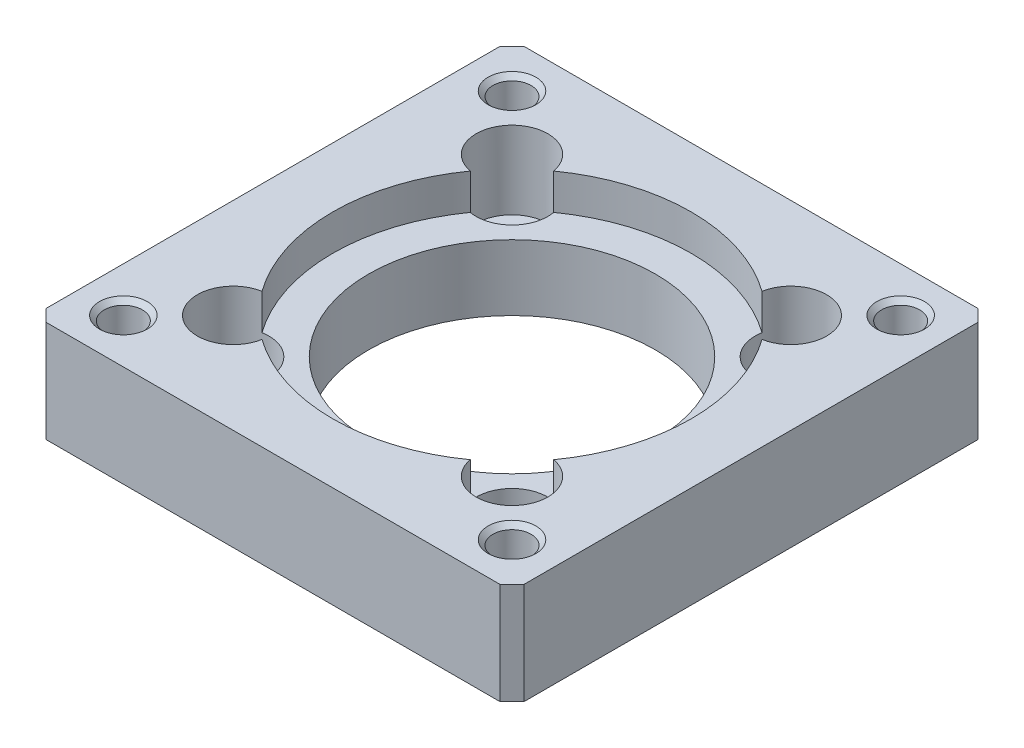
ISO-10303-21;
HEADER;
FILE_DESCRIPTION(('STEP AP214'),'2;1');
FILE_NAME('part.step','',(''),(''),'','','');
FILE_SCHEMA(('AUTOMOTIVE_DESIGN { 1 0 10303 214 1 1 1 1 }'));
ENDSEC;
DATA;
#1=APPLICATION_CONTEXT('core data for automotive mechanical design processes');
#2=APPLICATION_PROTOCOL_DEFINITION('international standard','automotive_design',2000,#1);
#3=PRODUCT_CONTEXT('',#1,'mechanical');
#4=PRODUCT('Part','Part','',(#3));
#5=PRODUCT_RELATED_PRODUCT_CATEGORY('part','',(#4));
#6=PRODUCT_DEFINITION_FORMATION('','',#4);
#7=PRODUCT_DEFINITION_CONTEXT('part definition',#1,'design');
#8=PRODUCT_DEFINITION('design','',#6,#7);
#9=PRODUCT_DEFINITION_SHAPE('','',#8);
#10=(LENGTH_UNIT() NAMED_UNIT(*) SI_UNIT(.MILLI.,.METRE.));
#11=(NAMED_UNIT(*) PLANE_ANGLE_UNIT() SI_UNIT($,.RADIAN.));
#12=(NAMED_UNIT(*) SI_UNIT($,.STERADIAN.) SOLID_ANGLE_UNIT());
#13=UNCERTAINTY_MEASURE_WITH_UNIT(LENGTH_MEASURE(1.E-05),#10,'distance_accuracy_value','');
#14=(GEOMETRIC_REPRESENTATION_CONTEXT(3) GLOBAL_UNCERTAINTY_ASSIGNED_CONTEXT((#13)) GLOBAL_UNIT_ASSIGNED_CONTEXT((#10,
#11,#12)) REPRESENTATION_CONTEXT('',''));
#15=CARTESIAN_POINT('',(0.,0.,0.));
#16=DIRECTION('',(0.,0.,1.));
#17=DIRECTION('',(1.,0.,0.));
#18=AXIS2_PLACEMENT_3D('',#15,#16,#17);
#19=CARTESIAN_POINT('',(-16.26345596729,8.10000000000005,16.26345596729));
#20=DIRECTION('',(0.,1.,0.));
#21=DIRECTION('',(0.,0.,1.));
#22=AXIS2_PLACEMENT_3D('',#19,#20,#21);
#23=CONICAL_SURFACE('',#22,1.59999999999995,0.785398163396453);
#24=CARTESIAN_POINT('',(-16.26345596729,8.1,16.26345596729));
#25=DIRECTION('',(0.,1.,0.));
#26=DIRECTION('',(1.,0.,0.));
#27=AXIS2_PLACEMENT_3D('',#24,#25,#26);
#28=CIRCLE('',#27,1.6);
#29=CARTESIAN_POINT('',(-14.66345596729,8.1,16.26345596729));
#30=VERTEX_POINT('',#29);
#31=EDGE_CURVE('E180',#30,#30,#28,.F.);
#32=ORIENTED_EDGE('',*,*,#31,.T.);
#33=EDGE_LOOP('',(#32));
#34=FACE_BOUND('',#33,.T.);
#35=CARTESIAN_POINT('',(-16.26345596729,8.50000000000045,16.26345596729));
#36=DIRECTION('',(0.,1.,0.));
#37=DIRECTION('',(0.,0.,1.));
#38=AXIS2_PLACEMENT_3D('',#35,#36,#37);
#39=CIRCLE('',#38,1.99999999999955);
#40=CARTESIAN_POINT('',(-16.26345596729,8.50000000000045,18.2634559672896));
#41=VERTEX_POINT('',#40);
#42=EDGE_CURVE('E206',#41,#41,#39,.T.);
#43=ORIENTED_EDGE('',*,*,#42,.T.);
#44=EDGE_LOOP('',(#43));
#45=FACE_BOUND('',#44,.T.);
#46=ADVANCED_FACE('F16',(#34,#45),#23,.F.);
#47=CARTESIAN_POINT('',(16.26345596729,8.10000000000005,16.26345596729));
#48=DIRECTION('',(0.,1.,0.));
#49=DIRECTION('',(0.,0.,1.));
#50=AXIS2_PLACEMENT_3D('',#47,#48,#49);
#51=CONICAL_SURFACE('',#50,1.59999999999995,0.785398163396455);
#52=CARTESIAN_POINT('',(16.26345596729,8.1,16.26345596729));
#53=DIRECTION('',(0.,1.,0.));
#54=DIRECTION('',(1.,0.,0.));
#55=AXIS2_PLACEMENT_3D('',#52,#53,#54);
#56=CIRCLE('',#55,1.6);
#57=CARTESIAN_POINT('',(17.86345596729,8.1,16.26345596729));
#58=VERTEX_POINT('',#57);
#59=EDGE_CURVE('E256',#58,#58,#56,.F.);
#60=ORIENTED_EDGE('',*,*,#59,.T.);
#61=EDGE_LOOP('',(#60));
#62=FACE_BOUND('',#61,.T.);
#63=CARTESIAN_POINT('',(16.26345596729,8.50000000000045,16.26345596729));
#64=DIRECTION('',(0.,1.,0.));
#65=DIRECTION('',(0.,0.,1.));
#66=AXIS2_PLACEMENT_3D('',#63,#64,#65);
#67=CIRCLE('',#66,1.99999999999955);
#68=CARTESIAN_POINT('',(16.26345596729,8.50000000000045,18.2634559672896));
#69=VERTEX_POINT('',#68);
#70=EDGE_CURVE('E203',#69,#69,#67,.T.);
#71=ORIENTED_EDGE('',*,*,#70,.T.);
#72=EDGE_LOOP('',(#71));
#73=FACE_BOUND('',#72,.T.);
#74=ADVANCED_FACE('F441',(#62,#73),#51,.F.);
#75=CARTESIAN_POINT('',(16.26345596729,8.10000000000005,-16.26345596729));
#76=DIRECTION('',(0.,1.,0.));
#77=DIRECTION('',(0.,0.,1.));
#78=AXIS2_PLACEMENT_3D('',#75,#76,#77);
#79=CONICAL_SURFACE('',#78,1.59999999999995,0.785398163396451);
#80=CARTESIAN_POINT('',(16.26345596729,8.1,-16.26345596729));
#81=DIRECTION('',(0.,1.,0.));
#82=DIRECTION('',(1.,0.,0.));
#83=AXIS2_PLACEMENT_3D('',#80,#81,#82);
#84=CIRCLE('',#83,1.6);
#85=CARTESIAN_POINT('',(17.86345596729,8.1,-16.26345596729));
#86=VERTEX_POINT('',#85);
#87=EDGE_CURVE('E253',#86,#86,#84,.F.);
#88=ORIENTED_EDGE('',*,*,#87,.T.);
#89=EDGE_LOOP('',(#88));
#90=FACE_BOUND('',#89,.T.);
#91=CARTESIAN_POINT('',(16.26345596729,8.50000000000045,-16.26345596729));
#92=DIRECTION('',(0.,1.,0.));
#93=DIRECTION('',(0.,0.,1.));
#94=AXIS2_PLACEMENT_3D('',#91,#92,#93);
#95=CIRCLE('',#94,1.99999999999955);
#96=CARTESIAN_POINT('',(16.26345596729,8.50000000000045,-14.2634559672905));
#97=VERTEX_POINT('',#96);
#98=EDGE_CURVE('E209',#97,#97,#95,.T.);
#99=ORIENTED_EDGE('',*,*,#98,.T.);
#100=EDGE_LOOP('',(#99));
#101=FACE_BOUND('',#100,.T.);
#102=ADVANCED_FACE('F481',(#90,#101),#79,.F.);
#103=CARTESIAN_POINT('',(-16.26345596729,8.10000000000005,-16.26345596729));
#104=DIRECTION('',(0.,1.,0.));
#105=DIRECTION('',(0.,0.,1.));
#106=AXIS2_PLACEMENT_3D('',#103,#104,#105);
#107=CONICAL_SURFACE('',#106,1.59999999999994,0.785398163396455);
#108=CARTESIAN_POINT('',(-16.26345596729,8.1,-16.26345596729));
#109=DIRECTION('',(0.,1.,0.));
#110=DIRECTION('',(1.,0.,0.));
#111=AXIS2_PLACEMENT_3D('',#108,#109,#110);
#112=CIRCLE('',#111,1.6);
#113=CARTESIAN_POINT('',(-14.66345596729,8.1,-16.26345596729));
#114=VERTEX_POINT('',#113);
#115=EDGE_CURVE('E177',#114,#114,#112,.F.);
#116=ORIENTED_EDGE('',*,*,#115,.T.);
#117=EDGE_LOOP('',(#116));
#118=FACE_BOUND('',#117,.T.);
#119=CARTESIAN_POINT('',(-16.26345596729,8.50000000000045,-16.26345596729));
#120=DIRECTION('',(0.,1.,0.));
#121=DIRECTION('',(0.,0.,1.));
#122=AXIS2_PLACEMENT_3D('',#119,#120,#121);
#123=CIRCLE('',#122,1.99999999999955);
#124=CARTESIAN_POINT('',(-16.26345596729,8.50000000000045,-14.2634559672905));
#125=VERTEX_POINT('',#124);
#126=EDGE_CURVE('E200',#125,#125,#123,.T.);
#127=ORIENTED_EDGE('',*,*,#126,.T.);
#128=EDGE_LOOP('',(#127));
#129=FACE_BOUND('',#128,.T.);
#130=ADVANCED_FACE('F488',(#118,#129),#107,.F.);
#131=CARTESIAN_POINT('',(11.66726188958,2.,-11.66726188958));
#132=DIRECTION('',(0.,1.,0.));
#133=DIRECTION('',(0.,0.,1.));
#134=AXIS2_PLACEMENT_3D('',#131,#132,#133);
#135=CYLINDRICAL_SURFACE('',#134,3.);
#136=CARTESIAN_POINT('',(11.66726188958,2.,-11.66726188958));
#137=DIRECTION('',(0.,1.,0.));
#138=DIRECTION('',(0.,0.,1.));
#139=AXIS2_PLACEMENT_3D('',#136,#137,#138);
#140=CIRCLE('',#139,3.);
#141=CARTESIAN_POINT('',(11.66726188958,2.,-8.66726188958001));
#142=VERTEX_POINT('',#141);
#143=EDGE_CURVE('E174',#142,#142,#140,.F.);
#144=ORIENTED_EDGE('',*,*,#143,.T.);
#145=EDGE_LOOP('',(#144));
#146=FACE_BOUND('',#145,.T.);
#147=DIRECTION('',(0.,-1.,0.));
#148=VECTOR('',#147,1.);
#149=CARTESIAN_POINT('',(12.2076072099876,7.,-8.7163252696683));
#150=LINE('',#149,#148);
#151=CARTESIAN_POINT('',(12.2076072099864,5.5,-8.71632526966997));
#152=VERTEX_POINT('',#151);
#153=CARTESIAN_POINT('',(12.2076072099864,8.5,-8.71632526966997));
#154=VERTEX_POINT('',#153);
#155=EDGE_CURVE('E248',#152,#154,#150,.F.);
#156=ORIENTED_EDGE('',*,*,#155,.T.);
#157=CARTESIAN_POINT('',(11.66726188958,8.5,-11.66726188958));
#158=DIRECTION('',(0.,1.,0.));
#159=DIRECTION('',(0.,0.,1.));
#160=AXIS2_PLACEMENT_3D('',#157,#158,#159);
#161=CIRCLE('',#160,3.);
#162=CARTESIAN_POINT('',(8.71632526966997,8.5,-12.2076072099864));
#163=VERTEX_POINT('',#162);
#164=EDGE_CURVE('E194',#154,#163,#161,.T.);
#165=ORIENTED_EDGE('',*,*,#164,.T.);
#166=DIRECTION('',(0.,1.,0.));
#167=VECTOR('',#166,1.);
#168=CARTESIAN_POINT('',(8.7163252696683,7.,-12.2076072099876));
#169=LINE('',#168,#167);
#170=CARTESIAN_POINT('',(8.71632526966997,5.5,-12.2076072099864));
#171=VERTEX_POINT('',#170);
#172=EDGE_CURVE('E237',#163,#171,#169,.F.);
#173=ORIENTED_EDGE('',*,*,#172,.T.);
#174=CARTESIAN_POINT('',(11.66726188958,5.5,-11.66726188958));
#175=DIRECTION('',(0.,1.,0.));
#176=DIRECTION('',(0.,0.,1.));
#177=AXIS2_PLACEMENT_3D('',#174,#175,#176);
#178=CIRCLE('',#177,3.);
#179=EDGE_CURVE('E162',#171,#152,#178,.T.);
#180=ORIENTED_EDGE('',*,*,#179,.T.);
#181=EDGE_LOOP('',(#156,#165,#173,#180));
#182=FACE_BOUND('',#181,.T.);
#183=ADVANCED_FACE('F352',(#146,#182),#135,.F.);
#184=CARTESIAN_POINT('',(0.,5.5,0.));
#185=DIRECTION('',(0.,1.,0.));
#186=DIRECTION('',(0.,0.,1.));
#187=AXIS2_PLACEMENT_3D('',#184,#185,#186);
#188=CYLINDRICAL_SURFACE('',#187,15.);
#189=CARTESIAN_POINT('',(0.,5.5,0.));
#190=DIRECTION('',(0.,1.,0.));
#191=DIRECTION('',(0.,0.,1.));
#192=AXIS2_PLACEMENT_3D('',#189,#190,#191);
#193=CIRCLE('',#192,15.);
#194=CARTESIAN_POINT('',(12.2076072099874,5.5,8.71632526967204));
#195=VERTEX_POINT('',#194);
#196=EDGE_CURVE('E140',#152,#195,#193,.F.);
#197=ORIENTED_EDGE('',*,*,#196,.T.);
#198=DIRECTION('',(0.,-1.,0.));
#199=VECTOR('',#198,1.);
#200=CARTESIAN_POINT('',(12.2076072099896,5.25,8.71632526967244));
#201=LINE('',#200,#199);
#202=CARTESIAN_POINT('',(12.2076072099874,8.5,8.71632526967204));
#203=VERTEX_POINT('',#202);
#204=EDGE_CURVE('E134',#195,#203,#201,.F.);
#205=ORIENTED_EDGE('',*,*,#204,.T.);
#206=CARTESIAN_POINT('',(0.,8.5,0.));
#207=DIRECTION('',(0.,1.,0.));
#208=DIRECTION('',(0.,0.,1.));
#209=AXIS2_PLACEMENT_3D('',#206,#207,#208);
#210=CIRCLE('',#209,15.);
#211=EDGE_CURVE('E197',#203,#154,#210,.T.);
#212=ORIENTED_EDGE('',*,*,#211,.T.);
#213=ORIENTED_EDGE('',*,*,#155,.F.);
#214=EDGE_LOOP('',(#197,#205,#212,#213));
#215=FACE_BOUND('',#214,.T.);
#216=ADVANCED_FACE('F349',(#215),#188,.F.);
#217=CARTESIAN_POINT('',(11.66726188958,2.,11.66726188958));
#218=DIRECTION('',(0.,1.,0.));
#219=DIRECTION('',(0.,0.,1.));
#220=AXIS2_PLACEMENT_3D('',#217,#218,#219);
#221=CYLINDRICAL_SURFACE('',#220,3.);
#222=CARTESIAN_POINT('',(11.66726188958,2.,11.66726188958));
#223=DIRECTION('',(0.,1.,0.));
#224=DIRECTION('',(0.,0.,1.));
#225=AXIS2_PLACEMENT_3D('',#222,#223,#224);
#226=CIRCLE('',#225,3.);
#227=CARTESIAN_POINT('',(11.66726188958,2.,14.66726188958));
#228=VERTEX_POINT('',#227);
#229=EDGE_CURVE('E171',#228,#228,#226,.F.);
#230=ORIENTED_EDGE('',*,*,#229,.T.);
#231=EDGE_LOOP('',(#230));
#232=FACE_BOUND('',#231,.T.);
#233=DIRECTION('',(0.,-1.,0.));
#234=VECTOR('',#233,1.);
#235=CARTESIAN_POINT('',(8.7163252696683,7.,12.2076072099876));
#236=LINE('',#235,#234);
#237=CARTESIAN_POINT('',(8.71632526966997,5.5,12.2076072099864));
#238=VERTEX_POINT('',#237);
#239=CARTESIAN_POINT('',(8.71632526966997,8.5,12.2076072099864));
#240=VERTEX_POINT('',#239);
#241=EDGE_CURVE('E131',#238,#240,#236,.F.);
#242=ORIENTED_EDGE('',*,*,#241,.T.);
#243=CARTESIAN_POINT('',(11.66726188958,8.5,11.66726188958));
#244=DIRECTION('',(0.,1.,0.));
#245=DIRECTION('',(0.,0.,1.));
#246=AXIS2_PLACEMENT_3D('',#243,#244,#245);
#247=CIRCLE('',#246,3.);
#248=EDGE_CURVE('E178',#240,#203,#247,.T.);
#249=ORIENTED_EDGE('',*,*,#248,.T.);
#250=ORIENTED_EDGE('',*,*,#204,.F.);
#251=CARTESIAN_POINT('',(11.66726188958,5.5,11.66726188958));
#252=DIRECTION('',(0.,1.,0.));
#253=DIRECTION('',(0.,0.,1.));
#254=AXIS2_PLACEMENT_3D('',#251,#252,#253);
#255=CIRCLE('',#254,3.);
#256=EDGE_CURVE('E127',#195,#238,#255,.T.);
#257=ORIENTED_EDGE('',*,*,#256,.T.);
#258=EDGE_LOOP('',(#242,#249,#250,#257));
#259=FACE_BOUND('',#258,.T.);
#260=ADVANCED_FACE('F129',(#232,#259),#221,.F.);
#261=CARTESIAN_POINT('',(0.,5.5,0.));
#262=DIRECTION('',(0.,1.,0.));
#263=DIRECTION('',(0.,0.,1.));
#264=AXIS2_PLACEMENT_3D('',#261,#262,#263);
#265=CYLINDRICAL_SURFACE('',#264,15.);
#266=CARTESIAN_POINT('',(0.,5.5,0.));
#267=DIRECTION('',(0.,1.,0.));
#268=DIRECTION('',(0.,0.,1.));
#269=AXIS2_PLACEMENT_3D('',#266,#267,#268);
#270=CIRCLE('',#269,15.);
#271=CARTESIAN_POINT('',(-8.71632526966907,5.5,12.2076072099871));
#272=VERTEX_POINT('',#271);
#273=EDGE_CURVE('E139',#238,#272,#270,.F.);
#274=ORIENTED_EDGE('',*,*,#273,.T.);
#275=DIRECTION('',(0.,1.,0.));
#276=VECTOR('',#275,1.);
#277=CARTESIAN_POINT('',(-8.7163252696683,7.,12.2076072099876));
#278=LINE('',#277,#276);
#279=CARTESIAN_POINT('',(-8.71632526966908,8.5,12.2076072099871));
#280=VERTEX_POINT('',#279);
#281=EDGE_CURVE('E148',#280,#272,#278,.F.);
#282=ORIENTED_EDGE('',*,*,#281,.F.);
#283=CARTESIAN_POINT('',(0.,8.5,0.));
#284=DIRECTION('',(0.,1.,0.));
#285=DIRECTION('',(0.,0.,1.));
#286=AXIS2_PLACEMENT_3D('',#283,#284,#285);
#287=CIRCLE('',#286,15.);
#288=EDGE_CURVE('E146',#280,#240,#287,.T.);
#289=ORIENTED_EDGE('',*,*,#288,.T.);
#290=ORIENTED_EDGE('',*,*,#241,.F.);
#291=EDGE_LOOP('',(#274,#282,#289,#290));
#292=FACE_BOUND('',#291,.T.);
#293=ADVANCED_FACE('F144',(#292),#265,.F.);
#294=CARTESIAN_POINT('',(-11.66726188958,2.,11.66726188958));
#295=DIRECTION('',(0.,1.,0.));
#296=DIRECTION('',(0.,0.,1.));
#297=AXIS2_PLACEMENT_3D('',#294,#295,#296);
#298=CYLINDRICAL_SURFACE('',#297,3.000000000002);
#299=CARTESIAN_POINT('',(-11.66726188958,2.,11.66726188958));
#300=DIRECTION('',(0.,1.,0.));
#301=DIRECTION('',(0.,0.,1.));
#302=AXIS2_PLACEMENT_3D('',#299,#300,#301);
#303=CIRCLE('',#302,3.000000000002);
#304=CARTESIAN_POINT('',(-11.66726188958,2.,14.667261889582));
#305=VERTEX_POINT('',#304);
#306=EDGE_CURVE('E165',#305,#305,#303,.F.);
#307=ORIENTED_EDGE('',*,*,#306,.T.);
#308=EDGE_LOOP('',(#307));
#309=FACE_BOUND('',#308,.T.);
#310=DIRECTION('',(0.,-1.,0.));
#311=VECTOR('',#310,1.);
#312=CARTESIAN_POINT('',(-12.2076072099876,7.,8.7163252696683));
#313=LINE('',#312,#311);
#314=CARTESIAN_POINT('',(-12.2076072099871,5.5,8.71632526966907));
#315=VERTEX_POINT('',#314);
#316=CARTESIAN_POINT('',(-12.2076072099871,8.5,8.71632526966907));
#317=VERTEX_POINT('',#316);
#318=EDGE_CURVE('E147',#315,#317,#313,.F.);
#319=ORIENTED_EDGE('',*,*,#318,.T.);
#320=CARTESIAN_POINT('',(-11.66726188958,8.5,11.66726188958));
#321=DIRECTION('',(0.,1.,0.));
#322=DIRECTION('',(0.,0.,1.));
#323=AXIS2_PLACEMENT_3D('',#320,#321,#322);
#324=CIRCLE('',#323,3.000000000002);
#325=EDGE_CURVE('E182',#317,#280,#324,.T.);
#326=ORIENTED_EDGE('',*,*,#325,.T.);
#327=ORIENTED_EDGE('',*,*,#281,.T.);
#328=CARTESIAN_POINT('',(-11.66726188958,5.5,11.66726188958));
#329=DIRECTION('',(0.,1.,0.));
#330=DIRECTION('',(0.,0.,1.));
#331=AXIS2_PLACEMENT_3D('',#328,#329,#330);
#332=CIRCLE('',#331,3.000000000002);
#333=EDGE_CURVE('E154',#272,#315,#332,.T.);
#334=ORIENTED_EDGE('',*,*,#333,.T.);
#335=EDGE_LOOP('',(#319,#326,#327,#334));
#336=FACE_BOUND('',#335,.T.);
#337=ADVANCED_FACE('F343',(#309,#336),#298,.F.);
#338=CARTESIAN_POINT('',(0.,5.5,0.));
#339=DIRECTION('',(0.,1.,0.));
#340=DIRECTION('',(0.,0.,1.));
#341=AXIS2_PLACEMENT_3D('',#338,#339,#340);
#342=CYLINDRICAL_SURFACE('',#341,15.);
#343=CARTESIAN_POINT('',(0.,8.5,0.));
#344=DIRECTION('',(0.,1.,0.));
#345=DIRECTION('',(0.,0.,1.));
#346=AXIS2_PLACEMENT_3D('',#343,#344,#345);
#347=CIRCLE('',#346,15.);
#348=CARTESIAN_POINT('',(-12.2076072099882,8.5,-8.71632526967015));
#349=VERTEX_POINT('',#348);
#350=EDGE_CURVE('E185',#349,#317,#347,.T.);
#351=ORIENTED_EDGE('',*,*,#350,.T.);
#352=ORIENTED_EDGE('',*,*,#318,.F.);
#353=CARTESIAN_POINT('',(0.,5.5,0.));
#354=DIRECTION('',(0.,1.,0.));
#355=DIRECTION('',(0.,0.,1.));
#356=AXIS2_PLACEMENT_3D('',#353,#354,#355);
#357=CIRCLE('',#356,15.);
#358=CARTESIAN_POINT('',(-12.2076072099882,5.5,-8.71632526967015));
#359=VERTEX_POINT('',#358);
#360=EDGE_CURVE('E157',#315,#359,#357,.F.);
#361=ORIENTED_EDGE('',*,*,#360,.T.);
#362=DIRECTION('',(0.,-1.,0.));
#363=VECTOR('',#362,1.);
#364=CARTESIAN_POINT('',(-12.2076072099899,5.25,-8.71632526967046));
#365=LINE('',#364,#363);
#366=EDGE_CURVE('E240',#359,#349,#365,.F.);
#367=ORIENTED_EDGE('',*,*,#366,.T.);
#368=EDGE_LOOP('',(#351,#352,#361,#367));
#369=FACE_BOUND('',#368,.T.);
#370=ADVANCED_FACE('F339',(#369),#342,.F.);
#371=CARTESIAN_POINT('',(-11.66726188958,2.,-11.66726188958));
#372=DIRECTION('',(0.,1.,0.));
#373=DIRECTION('',(0.,0.,1.));
#374=AXIS2_PLACEMENT_3D('',#371,#372,#373);
#375=CYLINDRICAL_SURFACE('',#374,3.000000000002);
#376=CARTESIAN_POINT('',(-11.66726188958,2.,-11.66726188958));
#377=DIRECTION('',(0.,1.,0.));
#378=DIRECTION('',(0.,0.,1.));
#379=AXIS2_PLACEMENT_3D('',#376,#377,#378);
#380=CIRCLE('',#379,3.000000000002);
#381=CARTESIAN_POINT('',(-11.66726188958,2.,-8.667261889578));
#382=VERTEX_POINT('',#381);
#383=EDGE_CURVE('E168',#382,#382,#380,.F.);
#384=ORIENTED_EDGE('',*,*,#383,.T.);
#385=EDGE_LOOP('',(#384));
#386=FACE_BOUND('',#385,.T.);
#387=DIRECTION('',(0.,-1.,0.));
#388=VECTOR('',#387,1.);
#389=CARTESIAN_POINT('',(-8.7163252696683,7.,-12.2076072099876));
#390=LINE('',#389,#388);
#391=CARTESIAN_POINT('',(-8.71632526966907,5.5,-12.2076072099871));
#392=VERTEX_POINT('',#391);
#393=CARTESIAN_POINT('',(-8.71632526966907,8.5,-12.2076072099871));
#394=VERTEX_POINT('',#393);
#395=EDGE_CURVE('E236',#392,#394,#390,.F.);
#396=ORIENTED_EDGE('',*,*,#395,.T.);
#397=CARTESIAN_POINT('',(-11.66726188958,8.5,-11.66726188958));
#398=DIRECTION('',(0.,1.,0.));
#399=DIRECTION('',(0.,0.,1.));
#400=AXIS2_PLACEMENT_3D('',#397,#398,#399);
#401=CIRCLE('',#400,3.000000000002);
#402=EDGE_CURVE('E188',#394,#349,#401,.T.);
#403=ORIENTED_EDGE('',*,*,#402,.T.);
#404=ORIENTED_EDGE('',*,*,#366,.F.);
#405=CARTESIAN_POINT('',(-11.66726188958,5.5,-11.66726188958));
#406=DIRECTION('',(0.,1.,0.));
#407=DIRECTION('',(0.,0.,1.));
#408=AXIS2_PLACEMENT_3D('',#405,#406,#407);
#409=CIRCLE('',#408,3.000000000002);
#410=EDGE_CURVE('E336',#359,#392,#409,.T.);
#411=ORIENTED_EDGE('',*,*,#410,.T.);
#412=EDGE_LOOP('',(#396,#403,#404,#411));
#413=FACE_BOUND('',#412,.T.);
#414=ADVANCED_FACE('F357',(#386,#413),#375,.F.);
#415=CARTESIAN_POINT('',(0.,5.5,0.));
#416=DIRECTION('',(0.,1.,0.));
#417=DIRECTION('',(0.,0.,1.));
#418=AXIS2_PLACEMENT_3D('',#415,#416,#417);
#419=CYLINDRICAL_SURFACE('',#418,15.);
#420=CARTESIAN_POINT('',(0.,5.5,0.));
#421=DIRECTION('',(0.,1.,0.));
#422=DIRECTION('',(0.,0.,1.));
#423=AXIS2_PLACEMENT_3D('',#420,#421,#422);
#424=CIRCLE('',#423,15.);
#425=EDGE_CURVE('E291',#392,#171,#424,.F.);
#426=ORIENTED_EDGE('',*,*,#425,.T.);
#427=ORIENTED_EDGE('',*,*,#172,.F.);
#428=CARTESIAN_POINT('',(0.,8.5,0.));
#429=DIRECTION('',(0.,1.,0.));
#430=DIRECTION('',(0.,0.,1.));
#431=AXIS2_PLACEMENT_3D('',#428,#429,#430);
#432=CIRCLE('',#431,15.);
#433=EDGE_CURVE('E191',#163,#394,#432,.T.);
#434=ORIENTED_EDGE('',*,*,#433,.T.);
#435=ORIENTED_EDGE('',*,*,#395,.F.);
#436=EDGE_LOOP('',(#426,#427,#434,#435));
#437=FACE_BOUND('',#436,.T.);
#438=ADVANCED_FACE('F355',(#437),#419,.F.);
#439=CARTESIAN_POINT('',(-20.0528,8.67,-18.9472));
#440=DIRECTION('',(-0.707106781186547,0.,-0.707106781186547));
#441=DIRECTION('',(0.707106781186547,0.,-0.707106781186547));
#442=AXIS2_PLACEMENT_3D('',#439,#440,#441);
#443=PLANE('',#442);
#444=DIRECTION('',(0.707106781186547,0.,-0.707106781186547));
#445=VECTOR('',#444,1.);
#446=CARTESIAN_POINT('',(-20.0528,8.5,-18.9472));
#447=LINE('',#446,#445);
#448=CARTESIAN_POINT('',(-20.,8.5,-19.));
#449=VERTEX_POINT('',#448);
#450=CARTESIAN_POINT('',(-19.,8.5,-20.));
#451=VERTEX_POINT('',#450);
#452=EDGE_CURVE('E212',#449,#451,#447,.T.);
#453=ORIENTED_EDGE('',*,*,#452,.T.);
#454=DIRECTION('',(0.,1.,0.));
#455=VECTOR('',#454,1.);
#456=CARTESIAN_POINT('',(-19.,4.25,-20.));
#457=LINE('',#456,#455);
#458=CARTESIAN_POINT('',(-19.,0.,-20.));
#459=VERTEX_POINT('',#458);
#460=EDGE_CURVE('E268',#451,#459,#457,.F.);
#461=ORIENTED_EDGE('',*,*,#460,.T.);
#462=DIRECTION('',(-0.707106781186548,0.,0.707106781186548));
#463=VECTOR('',#462,1.);
#464=CARTESIAN_POINT('',(-19.5,0.,-19.5));
#465=LINE('',#464,#463);
#466=CARTESIAN_POINT('',(-20.,0.,-19.));
#467=VERTEX_POINT('',#466);
#468=EDGE_CURVE('E234',#467,#459,#465,.F.);
#469=ORIENTED_EDGE('',*,*,#468,.F.);
#470=DIRECTION('',(0.,-1.,0.));
#471=VECTOR('',#470,1.);
#472=CARTESIAN_POINT('',(-20.,4.25,-19.));
#473=LINE('',#472,#471);
#474=EDGE_CURVE('E265',#467,#449,#473,.F.);
#475=ORIENTED_EDGE('',*,*,#474,.T.);
#476=EDGE_LOOP('',(#453,#461,#469,#475));
#477=FACE_BOUND('',#476,.T.);
#478=ADVANCED_FACE('F366',(#477),#443,.T.);
#479=CARTESIAN_POINT('',(-18.9472,8.67,20.0528));
#480=DIRECTION('',(-0.707106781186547,0.,0.707106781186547));
#481=DIRECTION('',(-0.707106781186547,0.,-0.707106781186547));
#482=AXIS2_PLACEMENT_3D('',#479,#480,#481);
#483=PLANE('',#482);
#484=DIRECTION('',(-0.707106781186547,0.,-0.707106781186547));
#485=VECTOR('',#484,1.);
#486=CARTESIAN_POINT('',(-18.9472,8.5,20.0528));
#487=LINE('',#486,#485);
#488=CARTESIAN_POINT('',(-19.,8.5,20.));
#489=VERTEX_POINT('',#488);
#490=CARTESIAN_POINT('',(-20.,8.5,19.));
#491=VERTEX_POINT('',#490);
#492=EDGE_CURVE('E214',#489,#491,#487,.T.);
#493=ORIENTED_EDGE('',*,*,#492,.T.);
#494=DIRECTION('',(0.,1.,0.));
#495=VECTOR('',#494,1.);
#496=CARTESIAN_POINT('',(-20.,4.25,19.));
#497=LINE('',#496,#495);
#498=CARTESIAN_POINT('',(-20.,0.,19.));
#499=VERTEX_POINT('',#498);
#500=EDGE_CURVE('E264',#491,#499,#497,.F.);
#501=ORIENTED_EDGE('',*,*,#500,.T.);
#502=DIRECTION('',(0.707106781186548,0.,0.707106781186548));
#503=VECTOR('',#502,1.);
#504=CARTESIAN_POINT('',(-19.5,0.,19.5));
#505=LINE('',#504,#503);
#506=CARTESIAN_POINT('',(-19.,0.,20.));
#507=VERTEX_POINT('',#506);
#508=EDGE_CURVE('E227',#507,#499,#505,.F.);
#509=ORIENTED_EDGE('',*,*,#508,.F.);
#510=DIRECTION('',(0.,-1.,0.));
#511=VECTOR('',#510,1.);
#512=CARTESIAN_POINT('',(-19.,4.25,20.));
#513=LINE('',#512,#511);
#514=EDGE_CURVE('E279',#507,#489,#513,.F.);
#515=ORIENTED_EDGE('',*,*,#514,.T.);
#516=EDGE_LOOP('',(#493,#501,#509,#515));
#517=FACE_BOUND('',#516,.T.);
#518=ADVANCED_FACE('F495',(#517),#483,.T.);
#519=CARTESIAN_POINT('',(18.9472,8.67,-20.0528));
#520=DIRECTION('',(0.707106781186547,0.,-0.707106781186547));
#521=DIRECTION('',(0.707106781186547,0.,0.707106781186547));
#522=AXIS2_PLACEMENT_3D('',#519,#520,#521);
#523=PLANE('',#522);
#524=DIRECTION('',(0.707106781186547,0.,0.707106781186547));
#525=VECTOR('',#524,1.);
#526=CARTESIAN_POINT('',(18.9472,8.5,-20.0528));
#527=LINE('',#526,#525);
#528=CARTESIAN_POINT('',(19.,8.5,-20.));
#529=VERTEX_POINT('',#528);
#530=CARTESIAN_POINT('',(20.,8.5,-19.));
#531=VERTEX_POINT('',#530);
#532=EDGE_CURVE('E20',#529,#531,#527,.T.);
#533=ORIENTED_EDGE('',*,*,#532,.T.);
#534=DIRECTION('',(0.,1.,0.));
#535=VECTOR('',#534,1.);
#536=CARTESIAN_POINT('',(20.,4.25,-19.));
#537=LINE('',#536,#535);
#538=CARTESIAN_POINT('',(20.,0.,-19.));
#539=VERTEX_POINT('',#538);
#540=EDGE_CURVE('E288',#531,#539,#537,.F.);
#541=ORIENTED_EDGE('',*,*,#540,.T.);
#542=DIRECTION('',(-0.707106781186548,0.,-0.707106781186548));
#543=VECTOR('',#542,1.);
#544=CARTESIAN_POINT('',(19.5,0.,-19.5));
#545=LINE('',#544,#543);
#546=CARTESIAN_POINT('',(19.,0.,-20.));
#547=VERTEX_POINT('',#546);
#548=EDGE_CURVE('E222',#547,#539,#545,.F.);
#549=ORIENTED_EDGE('',*,*,#548,.F.);
#550=DIRECTION('',(0.,-1.,0.));
#551=VECTOR('',#550,1.);
#552=CARTESIAN_POINT('',(19.,4.25,-20.));
#553=LINE('',#552,#551);
#554=EDGE_CURVE('E274',#547,#529,#553,.F.);
#555=ORIENTED_EDGE('',*,*,#554,.T.);
#556=EDGE_LOOP('',(#533,#541,#549,#555));
#557=FACE_BOUND('',#556,.T.);
#558=ADVANCED_FACE('F498',(#557),#523,.T.);
#559=CARTESIAN_POINT('',(20.0528,8.67,18.9472));
#560=DIRECTION('',(0.707106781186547,0.,0.707106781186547));
#561=DIRECTION('',(-0.707106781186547,0.,0.707106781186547));
#562=AXIS2_PLACEMENT_3D('',#559,#560,#561);
#563=PLANE('',#562);
#564=DIRECTION('',(-0.707106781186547,0.,0.707106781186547));
#565=VECTOR('',#564,1.);
#566=CARTESIAN_POINT('',(20.0528,8.5,18.9472));
#567=LINE('',#566,#565);
#568=CARTESIAN_POINT('',(20.,8.5,19.));
#569=VERTEX_POINT('',#568);
#570=CARTESIAN_POINT('',(19.,8.5,20.));
#571=VERTEX_POINT('',#570);
#572=EDGE_CURVE('E215',#569,#571,#567,.T.);
#573=ORIENTED_EDGE('',*,*,#572,.T.);
#574=DIRECTION('',(0.,1.,0.));
#575=VECTOR('',#574,1.);
#576=CARTESIAN_POINT('',(19.,4.25,20.));
#577=LINE('',#576,#575);
#578=CARTESIAN_POINT('',(19.,0.,20.));
#579=VERTEX_POINT('',#578);
#580=EDGE_CURVE('E278',#571,#579,#577,.F.);
#581=ORIENTED_EDGE('',*,*,#580,.T.);
#582=DIRECTION('',(0.707106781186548,0.,-0.707106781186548));
#583=VECTOR('',#582,1.);
#584=CARTESIAN_POINT('',(19.5,0.,19.5));
#585=LINE('',#584,#583);
#586=CARTESIAN_POINT('',(20.,0.,19.));
#587=VERTEX_POINT('',#586);
#588=EDGE_CURVE('E35',#587,#579,#585,.F.);
#589=ORIENTED_EDGE('',*,*,#588,.F.);
#590=DIRECTION('',(0.,-1.,0.));
#591=VECTOR('',#590,1.);
#592=CARTESIAN_POINT('',(20.,4.25,19.));
#593=LINE('',#592,#591);
#594=EDGE_CURVE('E286',#587,#569,#593,.F.);
#595=ORIENTED_EDGE('',*,*,#594,.T.);
#596=EDGE_LOOP('',(#573,#581,#589,#595));
#597=FACE_BOUND('',#596,.T.);
#598=ADVANCED_FACE('F433',(#597),#563,.T.);
#599=CARTESIAN_POINT('',(-20.8,8.5,20.8));
#600=DIRECTION('',(0.,1.,0.));
#601=DIRECTION('',(1.,0.,0.));
#602=AXIS2_PLACEMENT_3D('',#599,#600,#601);
#603=PLANE('',#602);
#604=ORIENTED_EDGE('',*,*,#248,.F.);
#605=ORIENTED_EDGE('',*,*,#288,.F.);
#606=ORIENTED_EDGE('',*,*,#325,.F.);
#607=ORIENTED_EDGE('',*,*,#350,.F.);
#608=ORIENTED_EDGE('',*,*,#402,.F.);
#609=ORIENTED_EDGE('',*,*,#433,.F.);
#610=ORIENTED_EDGE('',*,*,#164,.F.);
#611=ORIENTED_EDGE('',*,*,#211,.F.);
#612=EDGE_LOOP('',(#604,#605,#606,#607,#608,#609,#610,#611));
#613=FACE_BOUND('',#612,.T.);
#614=ORIENTED_EDGE('',*,*,#126,.F.);
#615=EDGE_LOOP('',(#614));
#616=FACE_BOUND('',#615,.T.);
#617=ORIENTED_EDGE('',*,*,#70,.F.);
#618=EDGE_LOOP('',(#617));
#619=FACE_BOUND('',#618,.T.);
#620=ORIENTED_EDGE('',*,*,#42,.F.);
#621=EDGE_LOOP('',(#620));
#622=FACE_BOUND('',#621,.T.);
#623=ORIENTED_EDGE('',*,*,#98,.F.);
#624=EDGE_LOOP('',(#623));
#625=FACE_BOUND('',#624,.T.);
#626=ORIENTED_EDGE('',*,*,#452,.F.);
#627=DIRECTION('',(0.,0.,-1.));
#628=VECTOR('',#627,1.);
#629=CARTESIAN_POINT('',(-20.,8.5,0.));
#630=LINE('',#629,#628);
#631=EDGE_CURVE('E261',#449,#491,#630,.F.);
#632=ORIENTED_EDGE('',*,*,#631,.T.);
#633=ORIENTED_EDGE('',*,*,#492,.F.);
#634=DIRECTION('',(-1.,0.,0.));
#635=VECTOR('',#634,1.);
#636=CARTESIAN_POINT('',(0.,8.5,20.));
#637=LINE('',#636,#635);
#638=EDGE_CURVE('E275',#489,#571,#637,.F.);
#639=ORIENTED_EDGE('',*,*,#638,.T.);
#640=ORIENTED_EDGE('',*,*,#572,.F.);
#641=DIRECTION('',(0.,0.,1.));
#642=VECTOR('',#641,1.);
#643=CARTESIAN_POINT('',(20.,8.5,0.));
#644=LINE('',#643,#642);
#645=EDGE_CURVE('E284',#569,#531,#644,.F.);
#646=ORIENTED_EDGE('',*,*,#645,.T.);
#647=ORIENTED_EDGE('',*,*,#532,.F.);
#648=DIRECTION('',(1.,0.,0.));
#649=VECTOR('',#648,1.);
#650=CARTESIAN_POINT('',(0.,8.5,-20.));
#651=LINE('',#650,#649);
#652=EDGE_CURVE('E271',#529,#451,#651,.F.);
#653=ORIENTED_EDGE('',*,*,#652,.T.);
#654=EDGE_LOOP('',(#626,#632,#633,#639,#640,#646,#647,#653));
#655=FACE_BOUND('',#654,.T.);
#656=ADVANCED_FACE('F345',(#613,#616,#619,#622,#625,#655),#603,.T.);
#657=CARTESIAN_POINT('',(-16.26345596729,0.399999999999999,16.26345596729));
#658=DIRECTION('',(0.,1.,0.));
#659=DIRECTION('',(0.,0.,1.));
#660=AXIS2_PLACEMENT_3D('',#657,#658,#659);
#661=CYLINDRICAL_SURFACE('',#660,1.6);
#662=CARTESIAN_POINT('',(-16.26345596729,0.399999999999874,16.26345596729));
#663=DIRECTION('',(0.,-1.,0.));
#664=DIRECTION('',(0.,0.,-1.));
#665=AXIS2_PLACEMENT_3D('',#662,#663,#664);
#666=CIRCLE('',#665,1.59999999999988);
#667=CARTESIAN_POINT('',(-16.26345596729,0.399999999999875,14.6634559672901));
#668=VERTEX_POINT('',#667);
#669=EDGE_CURVE('E230',#668,#668,#666,.T.);
#670=ORIENTED_EDGE('',*,*,#669,.T.);
#671=EDGE_LOOP('',(#670));
#672=FACE_BOUND('',#671,.T.);
#673=ORIENTED_EDGE('',*,*,#31,.F.);
#674=EDGE_LOOP('',(#673));
#675=FACE_BOUND('',#674,.T.);
#676=ADVANCED_FACE('F426',(#672,#675),#661,.F.);
#677=CARTESIAN_POINT('',(16.26345596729,0.399999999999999,16.26345596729));
#678=DIRECTION('',(0.,1.,0.));
#679=DIRECTION('',(0.,0.,1.));
#680=AXIS2_PLACEMENT_3D('',#677,#678,#679);
#681=CYLINDRICAL_SURFACE('',#680,1.6);
#682=CARTESIAN_POINT('',(16.26345596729,0.399999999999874,16.26345596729));
#683=DIRECTION('',(0.,-1.,0.));
#684=DIRECTION('',(0.,0.,-1.));
#685=AXIS2_PLACEMENT_3D('',#682,#683,#684);
#686=CIRCLE('',#685,1.59999999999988);
#687=CARTESIAN_POINT('',(16.26345596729,0.399999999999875,14.6634559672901));
#688=VERTEX_POINT('',#687);
#689=EDGE_CURVE('E472',#688,#688,#686,.T.);
#690=ORIENTED_EDGE('',*,*,#689,.T.);
#691=EDGE_LOOP('',(#690));
#692=FACE_BOUND('',#691,.T.);
#693=ORIENTED_EDGE('',*,*,#59,.F.);
#694=EDGE_LOOP('',(#693));
#695=FACE_BOUND('',#694,.T.);
#696=ADVANCED_FACE('F422',(#692,#695),#681,.F.);
#697=CARTESIAN_POINT('',(16.26345596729,0.399999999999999,-16.26345596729));
#698=DIRECTION('',(0.,1.,0.));
#699=DIRECTION('',(0.,0.,1.));
#700=AXIS2_PLACEMENT_3D('',#697,#698,#699);
#701=CYLINDRICAL_SURFACE('',#700,1.6);
#702=CARTESIAN_POINT('',(16.26345596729,0.399999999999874,-16.26345596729));
#703=DIRECTION('',(0.,-1.,0.));
#704=DIRECTION('',(0.,0.,-1.));
#705=AXIS2_PLACEMENT_3D('',#702,#703,#704);
#706=CIRCLE('',#705,1.59999999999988);
#707=CARTESIAN_POINT('',(16.26345596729,0.399999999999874,-17.8634559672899));
#708=VERTEX_POINT('',#707);
#709=EDGE_CURVE('E470',#708,#708,#706,.T.);
#710=ORIENTED_EDGE('',*,*,#709,.T.);
#711=EDGE_LOOP('',(#710));
#712=FACE_BOUND('',#711,.T.);
#713=ORIENTED_EDGE('',*,*,#87,.F.);
#714=EDGE_LOOP('',(#713));
#715=FACE_BOUND('',#714,.T.);
#716=ADVANCED_FACE('F418',(#712,#715),#701,.F.);
#717=CARTESIAN_POINT('',(-16.26345596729,0.399999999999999,-16.26345596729));
#718=DIRECTION('',(0.,1.,0.));
#719=DIRECTION('',(0.,0.,1.));
#720=AXIS2_PLACEMENT_3D('',#717,#718,#719);
#721=CYLINDRICAL_SURFACE('',#720,1.6);
#722=CARTESIAN_POINT('',(-16.26345596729,0.399999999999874,-16.26345596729));
#723=DIRECTION('',(0.,-1.,0.));
#724=DIRECTION('',(0.,0.,-1.));
#725=AXIS2_PLACEMENT_3D('',#722,#723,#724);
#726=CIRCLE('',#725,1.59999999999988);
#727=CARTESIAN_POINT('',(-16.26345596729,0.399999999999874,-17.8634559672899));
#728=VERTEX_POINT('',#727);
#729=EDGE_CURVE('E333',#728,#728,#726,.T.);
#730=ORIENTED_EDGE('',*,*,#729,.T.);
#731=EDGE_LOOP('',(#730));
#732=FACE_BOUND('',#731,.T.);
#733=ORIENTED_EDGE('',*,*,#115,.F.);
#734=EDGE_LOOP('',(#733));
#735=FACE_BOUND('',#734,.T.);
#736=ADVANCED_FACE('F414',(#732,#735),#721,.F.);
#737=CARTESIAN_POINT('',(-15.25395236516,2.,15.25395236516));
#738=DIRECTION('',(0.,1.,0.));
#739=DIRECTION('',(1.,0.,0.));
#740=AXIS2_PLACEMENT_3D('',#737,#738,#739);
#741=PLANE('',#740);
#742=CARTESIAN_POINT('',(11.66726188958,2.,-11.66726188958));
#743=DIRECTION('',(0.,1.,0.));
#744=DIRECTION('',(0.,0.,1.));
#745=AXIS2_PLACEMENT_3D('',#742,#743,#744);
#746=CIRCLE('',#745,1.75);
#747=CARTESIAN_POINT('',(11.66726188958,2.,-9.91726188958));
#748=VERTEX_POINT('',#747);
#749=EDGE_CURVE('E330',#748,#748,#746,.F.);
#750=ORIENTED_EDGE('',*,*,#749,.T.);
#751=EDGE_LOOP('',(#750));
#752=FACE_BOUND('',#751,.T.);
#753=ORIENTED_EDGE('',*,*,#143,.F.);
#754=EDGE_LOOP('',(#753));
#755=FACE_BOUND('',#754,.T.);
#756=ADVANCED_FACE('F417',(#752,#755),#741,.T.);
#757=CARTESIAN_POINT('',(-15.25395236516,2.,15.25395236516));
#758=DIRECTION('',(0.,1.,0.));
#759=DIRECTION('',(1.,0.,0.));
#760=AXIS2_PLACEMENT_3D('',#757,#758,#759);
#761=PLANE('',#760);
#762=CARTESIAN_POINT('',(11.66726188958,2.,11.66726188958));
#763=DIRECTION('',(0.,1.,0.));
#764=DIRECTION('',(0.,0.,1.));
#765=AXIS2_PLACEMENT_3D('',#762,#763,#764);
#766=CIRCLE('',#765,1.75);
#767=CARTESIAN_POINT('',(11.66726188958,2.,13.41726188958));
#768=VERTEX_POINT('',#767);
#769=EDGE_CURVE('E327',#768,#768,#766,.F.);
#770=ORIENTED_EDGE('',*,*,#769,.T.);
#771=EDGE_LOOP('',(#770));
#772=FACE_BOUND('',#771,.T.);
#773=ORIENTED_EDGE('',*,*,#229,.F.);
#774=EDGE_LOOP('',(#773));
#775=FACE_BOUND('',#774,.T.);
#776=ADVANCED_FACE('F506',(#772,#775),#761,.T.);
#777=CARTESIAN_POINT('',(-15.25395236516,2.,15.25395236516));
#778=DIRECTION('',(0.,1.,0.));
#779=DIRECTION('',(1.,0.,0.));
#780=AXIS2_PLACEMENT_3D('',#777,#778,#779);
#781=PLANE('',#780);
#782=CARTESIAN_POINT('',(-11.66726188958,2.,-11.66726188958));
#783=DIRECTION('',(0.,1.,0.));
#784=DIRECTION('',(0.,0.,1.));
#785=AXIS2_PLACEMENT_3D('',#782,#783,#784);
#786=CIRCLE('',#785,1.750000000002);
#787=CARTESIAN_POINT('',(-11.66726188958,2.,-9.917261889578));
#788=VERTEX_POINT('',#787);
#789=EDGE_CURVE('E324',#788,#788,#786,.F.);
#790=ORIENTED_EDGE('',*,*,#789,.T.);
#791=EDGE_LOOP('',(#790));
#792=FACE_BOUND('',#791,.T.);
#793=ORIENTED_EDGE('',*,*,#383,.F.);
#794=EDGE_LOOP('',(#793));
#795=FACE_BOUND('',#794,.T.);
#796=ADVANCED_FACE('F510',(#792,#795),#781,.T.);
#797=CARTESIAN_POINT('',(-15.25395236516,2.,15.25395236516));
#798=DIRECTION('',(0.,1.,0.));
#799=DIRECTION('',(1.,0.,0.));
#800=AXIS2_PLACEMENT_3D('',#797,#798,#799);
#801=PLANE('',#800);
#802=CARTESIAN_POINT('',(-11.66726188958,2.,11.66726188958));
#803=DIRECTION('',(0.,1.,0.));
#804=DIRECTION('',(0.,0.,1.));
#805=AXIS2_PLACEMENT_3D('',#802,#803,#804);
#806=CIRCLE('',#805,1.750000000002);
#807=CARTESIAN_POINT('',(-11.66726188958,2.,13.417261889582));
#808=VERTEX_POINT('',#807);
#809=EDGE_CURVE('E321',#808,#808,#806,.F.);
#810=ORIENTED_EDGE('',*,*,#809,.T.);
#811=EDGE_LOOP('',(#810));
#812=FACE_BOUND('',#811,.T.);
#813=ORIENTED_EDGE('',*,*,#306,.F.);
#814=EDGE_LOOP('',(#813));
#815=FACE_BOUND('',#814,.T.);
#816=ADVANCED_FACE('F514',(#812,#815),#801,.T.);
#817=CARTESIAN_POINT('',(-15.61093206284,5.5,15.61092929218));
#818=DIRECTION('',(0.,1.,0.));
#819=DIRECTION('',(1.,0.,0.));
#820=AXIS2_PLACEMENT_3D('',#817,#818,#819);
#821=PLANE('',#820);
#822=CARTESIAN_POINT('',(0.,5.5,0.));
#823=DIRECTION('',(0.,1.,0.));
#824=DIRECTION('',(0.,0.,1.));
#825=AXIS2_PLACEMENT_3D('',#822,#823,#824);
#826=CIRCLE('',#825,12.);
#827=CARTESIAN_POINT('',(0.,5.5,12.));
#828=VERTEX_POINT('',#827);
#829=EDGE_CURVE('E317',#828,#828,#826,.F.);
#830=ORIENTED_EDGE('',*,*,#829,.T.);
#831=EDGE_LOOP('',(#830));
#832=FACE_BOUND('',#831,.T.);
#833=ORIENTED_EDGE('',*,*,#425,.F.);
#834=ORIENTED_EDGE('',*,*,#410,.F.);
#835=ORIENTED_EDGE('',*,*,#360,.F.);
#836=ORIENTED_EDGE('',*,*,#333,.F.);
#837=ORIENTED_EDGE('',*,*,#273,.F.);
#838=ORIENTED_EDGE('',*,*,#256,.F.);
#839=ORIENTED_EDGE('',*,*,#196,.F.);
#840=ORIENTED_EDGE('',*,*,#179,.F.);
#841=EDGE_LOOP('',(#833,#834,#835,#836,#837,#838,#839,#840));
#842=FACE_BOUND('',#841,.T.);
#843=ADVANCED_FACE('F151',(#832,#842),#821,.T.);
#844=CARTESIAN_POINT('',(19.76,-0.17,-20.));
#845=DIRECTION('',(0.,0.,-1.));
#846=DIRECTION('',(-1.,0.,0.));
#847=AXIS2_PLACEMENT_3D('',#844,#845,#846);
#848=PLANE('',#847);
#849=ORIENTED_EDGE('',*,*,#460,.F.);
#850=ORIENTED_EDGE('',*,*,#652,.F.);
#851=ORIENTED_EDGE('',*,*,#554,.F.);
#852=DIRECTION('',(-1.,0.,0.));
#853=VECTOR('',#852,1.);
#854=CARTESIAN_POINT('',(0.,0.,-20.));
#855=LINE('',#854,#853);
#856=EDGE_CURVE('E320',#547,#459,#855,.T.);
#857=ORIENTED_EDGE('',*,*,#856,.T.);
#858=EDGE_LOOP('',(#849,#850,#851,#857));
#859=FACE_BOUND('',#858,.T.);
#860=ADVANCED_FACE('F521',(#859),#848,.T.);
#861=CARTESIAN_POINT('',(-20.,-0.17,-19.76));
#862=DIRECTION('',(-1.,0.,0.));
#863=DIRECTION('',(0.,0.,1.));
#864=AXIS2_PLACEMENT_3D('',#861,#862,#863);
#865=PLANE('',#864);
#866=ORIENTED_EDGE('',*,*,#500,.F.);
#867=ORIENTED_EDGE('',*,*,#631,.F.);
#868=ORIENTED_EDGE('',*,*,#474,.F.);
#869=DIRECTION('',(0.,0.,1.));
#870=VECTOR('',#869,1.);
#871=CARTESIAN_POINT('',(-20.,0.,0.));
#872=LINE('',#871,#870);
#873=EDGE_CURVE('E460',#467,#499,#872,.T.);
#874=ORIENTED_EDGE('',*,*,#873,.T.);
#875=EDGE_LOOP('',(#866,#867,#868,#874));
#876=FACE_BOUND('',#875,.T.);
#877=ADVANCED_FACE('F455',(#876),#865,.T.);
#878=CARTESIAN_POINT('',(-19.76,-0.17,20.));
#879=DIRECTION('',(0.,0.,1.));
#880=DIRECTION('',(1.,0.,0.));
#881=AXIS2_PLACEMENT_3D('',#878,#879,#880);
#882=PLANE('',#881);
#883=ORIENTED_EDGE('',*,*,#580,.F.);
#884=ORIENTED_EDGE('',*,*,#638,.F.);
#885=ORIENTED_EDGE('',*,*,#514,.F.);
#886=DIRECTION('',(1.,0.,0.));
#887=VECTOR('',#886,1.);
#888=CARTESIAN_POINT('',(0.,0.,20.));
#889=LINE('',#888,#887);
#890=EDGE_CURVE('E461',#507,#579,#889,.T.);
#891=ORIENTED_EDGE('',*,*,#890,.T.);
#892=EDGE_LOOP('',(#883,#884,#885,#891));
#893=FACE_BOUND('',#892,.T.);
#894=ADVANCED_FACE('F409',(#893),#882,.T.);
#895=CARTESIAN_POINT('',(20.,-0.17,19.76));
#896=DIRECTION('',(1.,0.,0.));
#897=DIRECTION('',(0.,0.,-1.));
#898=AXIS2_PLACEMENT_3D('',#895,#896,#897);
#899=PLANE('',#898);
#900=ORIENTED_EDGE('',*,*,#594,.F.);
#901=DIRECTION('',(0.,0.,-1.));
#902=VECTOR('',#901,1.);
#903=CARTESIAN_POINT('',(20.,0.,0.));
#904=LINE('',#903,#902);
#905=EDGE_CURVE('E316',#587,#539,#904,.T.);
#906=ORIENTED_EDGE('',*,*,#905,.T.);
#907=ORIENTED_EDGE('',*,*,#540,.F.);
#908=ORIENTED_EDGE('',*,*,#645,.F.);
#909=EDGE_LOOP('',(#900,#906,#907,#908));
#910=FACE_BOUND('',#909,.T.);
#911=ADVANCED_FACE('F399',(#910),#899,.T.);
#912=CARTESIAN_POINT('',(-16.26345596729,0.399999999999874,16.26345596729));
#913=DIRECTION('',(0.,-1.,0.));
#914=DIRECTION('',(0.,0.,-1.));
#915=AXIS2_PLACEMENT_3D('',#912,#913,#914);
#916=CONICAL_SURFACE('',#915,1.59999999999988,0.78539816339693);
#917=ORIENTED_EDGE('',*,*,#669,.F.);
#918=EDGE_LOOP('',(#917));
#919=FACE_BOUND('',#918,.T.);
#920=CARTESIAN_POINT('',(-16.26345596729,-3.30464822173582E-13,16.26345596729));
#921=DIRECTION('',(0.,-1.,0.));
#922=DIRECTION('',(0.,0.,-1.));
#923=AXIS2_PLACEMENT_3D('',#920,#921,#922);
#924=CIRCLE('',#923,1.99999999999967);
#925=CARTESIAN_POINT('',(-16.26345596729,-3.30464822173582E-13,14.2634559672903));
#926=VERTEX_POINT('',#925);
#927=EDGE_CURVE('E313',#926,#926,#924,.T.);
#928=ORIENTED_EDGE('',*,*,#927,.T.);
#929=EDGE_LOOP('',(#928));
#930=FACE_BOUND('',#929,.T.);
#931=ADVANCED_FACE('F396',(#919,#930),#916,.F.);
#932=CARTESIAN_POINT('',(16.26345596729,0.399999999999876,16.26345596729));
#933=DIRECTION('',(0.,-1.,0.));
#934=DIRECTION('',(0.,0.,-1.));
#935=AXIS2_PLACEMENT_3D('',#932,#933,#934);
#936=CONICAL_SURFACE('',#935,1.59999999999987,0.78539816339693);
#937=ORIENTED_EDGE('',*,*,#689,.F.);
#938=EDGE_LOOP('',(#937));
#939=FACE_BOUND('',#938,.T.);
#940=CARTESIAN_POINT('',(16.26345596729,-3.33066907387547E-13,16.26345596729));
#941=DIRECTION('',(0.,-1.,0.));
#942=DIRECTION('',(0.,0.,-1.));
#943=AXIS2_PLACEMENT_3D('',#940,#941,#942);
#944=CIRCLE('',#943,1.99999999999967);
#945=CARTESIAN_POINT('',(16.26345596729,-3.33066907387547E-13,14.2634559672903));
#946=VERTEX_POINT('',#945);
#947=EDGE_CURVE('E310',#946,#946,#944,.T.);
#948=ORIENTED_EDGE('',*,*,#947,.T.);
#949=EDGE_LOOP('',(#948));
#950=FACE_BOUND('',#949,.T.);
#951=ADVANCED_FACE('F398',(#939,#950),#936,.F.);
#952=CARTESIAN_POINT('',(16.26345596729,0.399999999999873,-16.26345596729));
#953=DIRECTION('',(0.,-1.,0.));
#954=DIRECTION('',(1.,0.,0.));
#955=AXIS2_PLACEMENT_3D('',#952,#953,#954);
#956=CONICAL_SURFACE('',#955,1.59999999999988,0.785398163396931);
#957=ORIENTED_EDGE('',*,*,#709,.F.);
#958=EDGE_LOOP('',(#957));
#959=FACE_BOUND('',#958,.T.);
#960=CARTESIAN_POINT('',(16.26345596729,-3.33066907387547E-13,-16.26345596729));
#961=DIRECTION('',(0.,-1.,0.));
#962=DIRECTION('',(0.,0.,-1.));
#963=AXIS2_PLACEMENT_3D('',#960,#961,#962);
#964=CIRCLE('',#963,1.99999999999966);
#965=CARTESIAN_POINT('',(16.26345596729,-3.33066907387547E-13,-18.2634559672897));
#966=VERTEX_POINT('',#965);
#967=EDGE_CURVE('E307',#966,#966,#964,.T.);
#968=ORIENTED_EDGE('',*,*,#967,.T.);
#969=EDGE_LOOP('',(#968));
#970=FACE_BOUND('',#969,.T.);
#971=ADVANCED_FACE('F406',(#959,#970),#956,.F.);
#972=CARTESIAN_POINT('',(-16.26345596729,0.399999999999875,-16.26345596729));
#973=DIRECTION('',(0.,-1.,0.));
#974=DIRECTION('',(0.,0.,-1.));
#975=AXIS2_PLACEMENT_3D('',#972,#973,#974);
#976=CONICAL_SURFACE('',#975,1.59999999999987,0.785398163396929);
#977=ORIENTED_EDGE('',*,*,#729,.F.);
#978=EDGE_LOOP('',(#977));
#979=FACE_BOUND('',#978,.T.);
#980=CARTESIAN_POINT('',(-16.26345596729,-3.34801630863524E-13,-16.26345596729));
#981=DIRECTION('',(0.,-1.,0.));
#982=DIRECTION('',(0.,0.,-1.));
#983=AXIS2_PLACEMENT_3D('',#980,#981,#982);
#984=CIRCLE('',#983,1.99999999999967);
#985=CARTESIAN_POINT('',(-16.26345596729,-3.34801630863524E-13,-18.2634559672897));
#986=VERTEX_POINT('',#985);
#987=EDGE_CURVE('E304',#986,#986,#984,.T.);
#988=ORIENTED_EDGE('',*,*,#987,.T.);
#989=EDGE_LOOP('',(#988));
#990=FACE_BOUND('',#989,.T.);
#991=ADVANCED_FACE('F567',(#979,#990),#976,.F.);
#992=CARTESIAN_POINT('',(11.66726188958,0.,-11.66726188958));
#993=DIRECTION('',(0.,1.,0.));
#994=DIRECTION('',(0.,0.,1.));
#995=AXIS2_PLACEMENT_3D('',#992,#993,#994);
#996=CYLINDRICAL_SURFACE('',#995,1.75);
#997=CARTESIAN_POINT('',(11.66726188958,0.,-11.66726188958));
#998=DIRECTION('',(0.,1.,0.));
#999=DIRECTION('',(0.,0.,1.));
#1000=AXIS2_PLACEMENT_3D('',#997,#998,#999);
#1001=CIRCLE('',#1000,1.75);
#1002=CARTESIAN_POINT('',(11.66726188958,0.,-9.91726188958));
#1003=VERTEX_POINT('',#1002);
#1004=EDGE_CURVE('E301',#1003,#1003,#1001,.F.);
#1005=ORIENTED_EDGE('',*,*,#1004,.T.);
#1006=EDGE_LOOP('',(#1005));
#1007=FACE_BOUND('',#1006,.T.);
#1008=ORIENTED_EDGE('',*,*,#749,.F.);
#1009=EDGE_LOOP('',(#1008));
#1010=FACE_BOUND('',#1009,.T.);
#1011=ADVANCED_FACE('F576',(#1007,#1010),#996,.F.);
#1012=CARTESIAN_POINT('',(11.66726188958,0.,11.66726188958));
#1013=DIRECTION('',(0.,1.,0.));
#1014=DIRECTION('',(0.,0.,1.));
#1015=AXIS2_PLACEMENT_3D('',#1012,#1013,#1014);
#1016=CYLINDRICAL_SURFACE('',#1015,1.75);
#1017=CARTESIAN_POINT('',(11.66726188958,0.,11.66726188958));
#1018=DIRECTION('',(0.,1.,0.));
#1019=DIRECTION('',(0.,0.,1.));
#1020=AXIS2_PLACEMENT_3D('',#1017,#1018,#1019);
#1021=CIRCLE('',#1020,1.75);
#1022=CARTESIAN_POINT('',(11.66726188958,0.,13.41726188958));
#1023=VERTEX_POINT('',#1022);
#1024=EDGE_CURVE('E298',#1023,#1023,#1021,.F.);
#1025=ORIENTED_EDGE('',*,*,#1024,.T.);
#1026=EDGE_LOOP('',(#1025));
#1027=FACE_BOUND('',#1026,.T.);
#1028=ORIENTED_EDGE('',*,*,#769,.F.);
#1029=EDGE_LOOP('',(#1028));
#1030=FACE_BOUND('',#1029,.T.);
#1031=ADVANCED_FACE('F586',(#1027,#1030),#1016,.F.);
#1032=CARTESIAN_POINT('',(-11.66726188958,0.,-11.66726188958));
#1033=DIRECTION('',(0.,1.,0.));
#1034=DIRECTION('',(0.,0.,1.));
#1035=AXIS2_PLACEMENT_3D('',#1032,#1033,#1034);
#1036=CYLINDRICAL_SURFACE('',#1035,1.750000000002);
#1037=CARTESIAN_POINT('',(-11.66726188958,0.,-11.66726188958));
#1038=DIRECTION('',(0.,1.,0.));
#1039=DIRECTION('',(0.,0.,1.));
#1040=AXIS2_PLACEMENT_3D('',#1037,#1038,#1039);
#1041=CIRCLE('',#1040,1.750000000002);
#1042=CARTESIAN_POINT('',(-11.66726188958,0.,-9.917261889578));
#1043=VERTEX_POINT('',#1042);
#1044=EDGE_CURVE('E295',#1043,#1043,#1041,.F.);
#1045=ORIENTED_EDGE('',*,*,#1044,.T.);
#1046=EDGE_LOOP('',(#1045));
#1047=FACE_BOUND('',#1046,.T.);
#1048=ORIENTED_EDGE('',*,*,#789,.F.);
#1049=EDGE_LOOP('',(#1048));
#1050=FACE_BOUND('',#1049,.T.);
#1051=ADVANCED_FACE('F596',(#1047,#1050),#1036,.F.);
#1052=CARTESIAN_POINT('',(-11.66726188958,0.,11.66726188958));
#1053=DIRECTION('',(0.,1.,0.));
#1054=DIRECTION('',(0.,0.,1.));
#1055=AXIS2_PLACEMENT_3D('',#1052,#1053,#1054);
#1056=CYLINDRICAL_SURFACE('',#1055,1.750000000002);
#1057=CARTESIAN_POINT('',(-11.66726188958,0.,11.66726188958));
#1058=DIRECTION('',(0.,1.,0.));
#1059=DIRECTION('',(0.,0.,1.));
#1060=AXIS2_PLACEMENT_3D('',#1057,#1058,#1059);
#1061=CIRCLE('',#1060,1.750000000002);
#1062=CARTESIAN_POINT('',(-11.66726188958,0.,13.417261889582));
#1063=VERTEX_POINT('',#1062);
#1064=EDGE_CURVE('E26',#1063,#1063,#1061,.F.);
#1065=ORIENTED_EDGE('',*,*,#1064,.T.);
#1066=EDGE_LOOP('',(#1065));
#1067=FACE_BOUND('',#1066,.T.);
#1068=ORIENTED_EDGE('',*,*,#809,.F.);
#1069=EDGE_LOOP('',(#1068));
#1070=FACE_BOUND('',#1069,.T.);
#1071=ADVANCED_FACE('F375',(#1067,#1070),#1056,.F.);
#1072=CARTESIAN_POINT('',(0.,0.,0.));
#1073=DIRECTION('',(0.,1.,0.));
#1074=DIRECTION('',(0.,0.,1.));
#1075=AXIS2_PLACEMENT_3D('',#1072,#1073,#1074);
#1076=CYLINDRICAL_SURFACE('',#1075,12.);
#1077=CARTESIAN_POINT('',(0.,0.,0.));
#1078=DIRECTION('',(0.,1.,0.));
#1079=DIRECTION('',(0.,0.,1.));
#1080=AXIS2_PLACEMENT_3D('',#1077,#1078,#1079);
#1081=CIRCLE('',#1080,12.);
#1082=CARTESIAN_POINT('',(0.,0.,12.));
#1083=VERTEX_POINT('',#1082);
#1084=EDGE_CURVE('E10',#1083,#1083,#1081,.F.);
#1085=ORIENTED_EDGE('',*,*,#1084,.T.);
#1086=EDGE_LOOP('',(#1085));
#1087=FACE_BOUND('',#1086,.T.);
#1088=ORIENTED_EDGE('',*,*,#829,.F.);
#1089=EDGE_LOOP('',(#1088));
#1090=FACE_BOUND('',#1089,.T.);
#1091=ADVANCED_FACE('F370',(#1087,#1090),#1076,.F.);
#1092=CARTESIAN_POINT('',(-20.8,0.,20.8));
#1093=DIRECTION('',(0.,1.,0.));
#1094=DIRECTION('',(1.,0.,0.));
#1095=AXIS2_PLACEMENT_3D('',#1092,#1093,#1094);
#1096=PLANE('',#1095);
#1097=ORIENTED_EDGE('',*,*,#1084,.F.);
#1098=EDGE_LOOP('',(#1097));
#1099=FACE_BOUND('',#1098,.T.);
#1100=ORIENTED_EDGE('',*,*,#1064,.F.);
#1101=EDGE_LOOP('',(#1100));
#1102=FACE_BOUND('',#1101,.T.);
#1103=ORIENTED_EDGE('',*,*,#1044,.F.);
#1104=EDGE_LOOP('',(#1103));
#1105=FACE_BOUND('',#1104,.T.);
#1106=ORIENTED_EDGE('',*,*,#1024,.F.);
#1107=EDGE_LOOP('',(#1106));
#1108=FACE_BOUND('',#1107,.T.);
#1109=ORIENTED_EDGE('',*,*,#1004,.F.);
#1110=EDGE_LOOP('',(#1109));
#1111=FACE_BOUND('',#1110,.T.);
#1112=ORIENTED_EDGE('',*,*,#987,.F.);
#1113=EDGE_LOOP('',(#1112));
#1114=FACE_BOUND('',#1113,.T.);
#1115=ORIENTED_EDGE('',*,*,#967,.F.);
#1116=EDGE_LOOP('',(#1115));
#1117=FACE_BOUND('',#1116,.T.);
#1118=ORIENTED_EDGE('',*,*,#947,.F.);
#1119=EDGE_LOOP('',(#1118));
#1120=FACE_BOUND('',#1119,.T.);
#1121=ORIENTED_EDGE('',*,*,#927,.F.);
#1122=EDGE_LOOP('',(#1121));
#1123=FACE_BOUND('',#1122,.T.);
#1124=ORIENTED_EDGE('',*,*,#588,.T.);
#1125=ORIENTED_EDGE('',*,*,#890,.F.);
#1126=ORIENTED_EDGE('',*,*,#508,.T.);
#1127=ORIENTED_EDGE('',*,*,#873,.F.);
#1128=ORIENTED_EDGE('',*,*,#468,.T.);
#1129=ORIENTED_EDGE('',*,*,#856,.F.);
#1130=ORIENTED_EDGE('',*,*,#548,.T.);
#1131=ORIENTED_EDGE('',*,*,#905,.F.);
#1132=EDGE_LOOP('',(#1124,#1125,#1126,#1127,#1128,#1129,#1130,#1131));
#1133=FACE_BOUND('',#1132,.T.);
#1134=ADVANCED_FACE('F18',(#1099,#1102,#1105,#1108,#1111,#1114,#1117,#1120,#1123,#1133),#1096,.F.);
#1135=CLOSED_SHELL('',(#46,#74,#102,#130,#183,#216,#260,#293,#337,#370,#414,#438,#478,#518,#558,
#598,#656,#676,#696,#716,#736,#756,#776,#796,#816,#843,#860,#877,#894,#911,#931,#951,#971,#991,
#1011,#1031,#1051,#1071,#1091,#1134));
#1136=MANIFOLD_SOLID_BREP('B1',#1135);
#1137=ADVANCED_BREP_SHAPE_REPRESENTATION('',(#18,#1136),#14);
#1138=SHAPE_DEFINITION_REPRESENTATION(#9,#1137);
ENDSEC;
END-ISO-10303-21;
